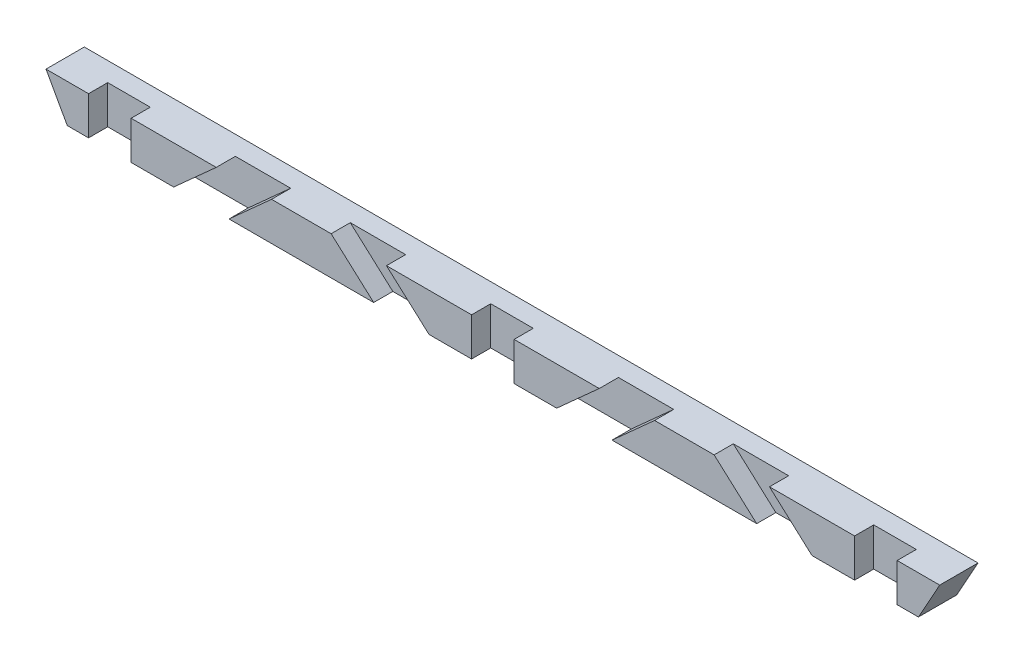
from build123d import *

# Parameters (mm, degrees)
ESQUISSE1_W             = 210
ESQUISSE1_H             = 9
EXTRUSION2_DEPTH        = 9
ENL_V_MAT_EXTRU_5_DEPTH = 9
ESQUISSE6_W             = 10
ESQUISSE6_H             = 9
ENL_V_MAT_EXTRU_7_DEPTH = 4.5
ENL_V_MAT_EXTRU_8_DEPTH = 4.5


with BuildPart() as part:
    # Esquisse1 → Extrusion2 (new body)
    with BuildSketch(Plane.XY):
        with Locations((105, 4.5)):
            Rectangle(ESQUISSE1_W, ESQUISSE1_H)
    extrude(amount=EXTRUSION2_DEPTH)

    # Esquisse5 → Enl_v. mat.-Extru.5 (cut)
    with BuildSketch(Plane.XY.offset(9)):
        Polygon((210, 0), (210, 9), (205, 0), align=None)
        Polygon((0, 0), (5, 0), (0, 9), align=None)
    extrude(amount=-ENL_V_MAT_EXTRU_5_DEPTH, mode=Mode.SUBTRACT)

    # Esquisse6 → Enl_v. mat.-Extru.7 (cut)
    with BuildSketch(Plane.XY.offset(9)):
        with Locations((15, 4.5)):
            Rectangle(ESQUISSE6_W, ESQUISSE6_H)
        with Locations((105, 4.5)):
            Rectangle(ESQUISSE6_W, ESQUISSE6_H)
        with Locations((195, 4.5)):
            Rectangle(ESQUISSE6_W, ESQUISSE6_H)
    extrude(amount=-ENL_V_MAT_EXTRU_7_DEPTH, mode=Mode.SUBTRACT)

    # Esquisse7 → Enl_v. mat.-Extru.8 (cut)
    with BuildSketch(Plane.XY.offset(9)):
        Polygon((40, 9), (53, 9), (43, 0), (30, 0), align=None)
        Polygon((67, 9), (80, 9), (90, 0), (77, 0), align=None)
        Polygon((130, 9), (120, 0), (133, 0), (143, 9), align=None)
        Polygon((170, 9), (157, 9), (167, 0), (180, 0), align=None)
    extrude(amount=-ENL_V_MAT_EXTRU_8_DEPTH, mode=Mode.SUBTRACT)


solid = part.part
